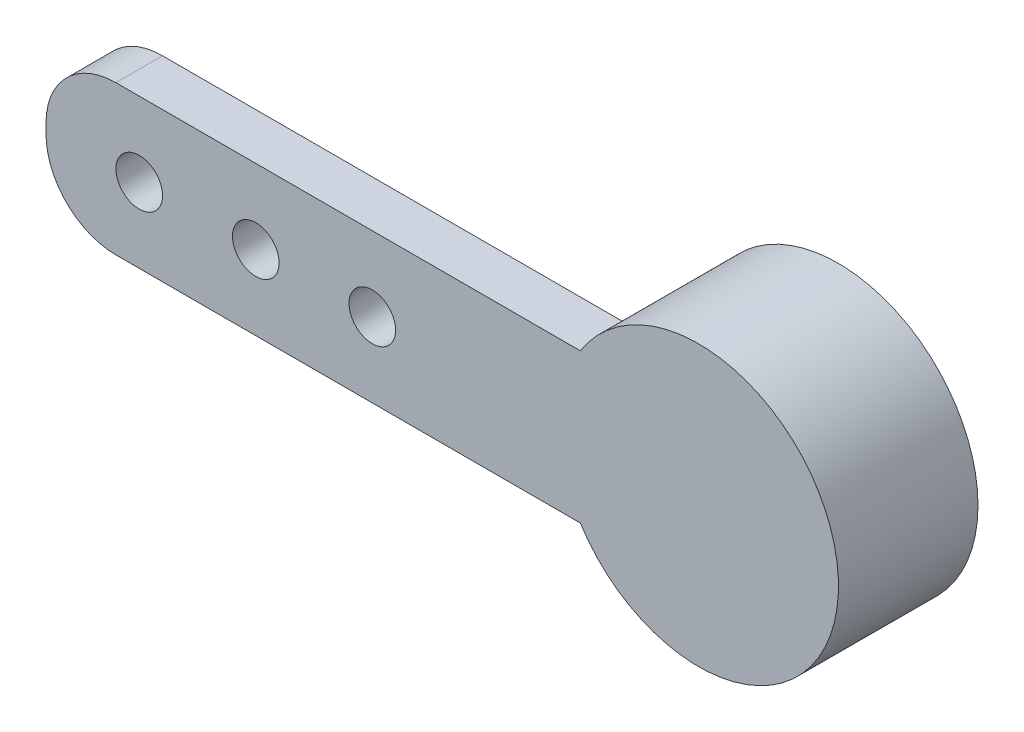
ISO-10303-21;
HEADER;
FILE_DESCRIPTION(('STEP AP214'),'2;1');
FILE_NAME('part.step','',(''),(''),'','','');
FILE_SCHEMA(('AUTOMOTIVE_DESIGN { 1 0 10303 214 1 1 1 1 }'));
ENDSEC;
DATA;
#1=APPLICATION_CONTEXT('core data for automotive mechanical design processes');
#2=APPLICATION_PROTOCOL_DEFINITION('international standard','automotive_design',2000,#1);
#3=PRODUCT_CONTEXT('',#1,'mechanical');
#4=PRODUCT('Part','Part','',(#3));
#5=PRODUCT_RELATED_PRODUCT_CATEGORY('part','',(#4));
#6=PRODUCT_DEFINITION_FORMATION('','',#4);
#7=PRODUCT_DEFINITION_CONTEXT('part definition',#1,'design');
#8=PRODUCT_DEFINITION('design','',#6,#7);
#9=PRODUCT_DEFINITION_SHAPE('','',#8);
#10=(LENGTH_UNIT() NAMED_UNIT(*) SI_UNIT(.MILLI.,.METRE.));
#11=(NAMED_UNIT(*) PLANE_ANGLE_UNIT() SI_UNIT($,.RADIAN.));
#12=(NAMED_UNIT(*) SI_UNIT($,.STERADIAN.) SOLID_ANGLE_UNIT());
#13=UNCERTAINTY_MEASURE_WITH_UNIT(LENGTH_MEASURE(1.E-05),#10,'distance_accuracy_value','');
#14=(GEOMETRIC_REPRESENTATION_CONTEXT(3) GLOBAL_UNCERTAINTY_ASSIGNED_CONTEXT((#13)) GLOBAL_UNIT_ASSIGNED_CONTEXT((#10,
#11,#12)) REPRESENTATION_CONTEXT('',''));
#15=CARTESIAN_POINT('',(0.,0.,0.));
#16=DIRECTION('',(0.,0.,1.));
#17=DIRECTION('',(1.,0.,0.));
#18=AXIS2_PLACEMENT_3D('',#15,#16,#17);
#19=CARTESIAN_POINT('',(-2.61728395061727,1.32778863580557,21.));
#20=DIRECTION('',(0.,0.,1.));
#21=DIRECTION('',(1.,0.,0.));
#22=AXIS2_PLACEMENT_3D('',#19,#20,#21);
#23=PLANE('',#22);
#24=DIRECTION('',(0.,-1.,0.));
#25=VECTOR('',#24,1.);
#26=CARTESIAN_POINT('',(-16.6172839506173,2.92778863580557,21.));
#27=LINE('',#26,#25);
#28=CARTESIAN_POINT('',(-16.6172839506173,1.42778863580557,21.));
#29=VERTEX_POINT('',#28);
#30=CARTESIAN_POINT('',(-16.6172839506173,1.22778863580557,21.));
#31=VERTEX_POINT('',#30);
#32=EDGE_CURVE('E136',#29,#31,#27,.T.);
#33=ORIENTED_EDGE('',*,*,#32,.T.);
#34=CARTESIAN_POINT('',(-15.1172839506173,1.22778863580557,21.));
#35=DIRECTION('',(0.,0.,1.));
#36=DIRECTION('',(1.,0.,0.));
#37=AXIS2_PLACEMENT_3D('',#34,#35,#36);
#38=CIRCLE('',#37,1.5);
#39=CARTESIAN_POINT('',(-15.1172839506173,-0.272211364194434,21.));
#40=VERTEX_POINT('',#39);
#41=EDGE_CURVE('E43',#31,#40,#38,.T.);
#42=ORIENTED_EDGE('',*,*,#41,.T.);
#43=DIRECTION('',(1.,0.,0.));
#44=VECTOR('',#43,1.);
#45=CARTESIAN_POINT('',(-16.6172839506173,-0.272211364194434,21.));
#46=LINE('',#45,#44);
#47=CARTESIAN_POINT('',(-5.15499945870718,-0.272211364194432,21.));
#48=VERTEX_POINT('',#47);
#49=EDGE_CURVE('E135',#40,#48,#46,.T.);
#50=ORIENTED_EDGE('',*,*,#49,.T.);
#51=CARTESIAN_POINT('',(-2.61728395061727,1.32778863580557,21.));
#52=DIRECTION('',(0.,0.,1.));
#53=DIRECTION('',(1.,0.,0.));
#54=AXIS2_PLACEMENT_3D('',#51,#52,#53);
#55=CIRCLE('',#54,3.);
#56=CARTESIAN_POINT('',(-5.15499945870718,2.92778863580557,21.));
#57=VERTEX_POINT('',#56);
#58=EDGE_CURVE('E114',#48,#57,#55,.T.);
#59=ORIENTED_EDGE('',*,*,#58,.T.);
#60=DIRECTION('',(-1.,0.,0.));
#61=VECTOR('',#60,1.);
#62=CARTESIAN_POINT('',(-16.6172839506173,2.92778863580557,21.));
#63=LINE('',#62,#61);
#64=CARTESIAN_POINT('',(-15.1172839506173,2.92778863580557,21.));
#65=VERTEX_POINT('',#64);
#66=EDGE_CURVE('E119',#57,#65,#63,.T.);
#67=ORIENTED_EDGE('',*,*,#66,.T.);
#68=CARTESIAN_POINT('',(-15.1172839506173,1.42778863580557,21.));
#69=DIRECTION('',(0.,0.,1.));
#70=DIRECTION('',(1.,0.,0.));
#71=AXIS2_PLACEMENT_3D('',#68,#69,#70);
#72=CIRCLE('',#71,1.5);
#73=EDGE_CURVE('E130',#65,#29,#72,.T.);
#74=ORIENTED_EDGE('',*,*,#73,.T.);
#75=EDGE_LOOP('',(#33,#42,#50,#59,#67,#74));
#76=FACE_BOUND('',#75,.T.);
#77=CARTESIAN_POINT('',(-12.1172839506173,1.32778863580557,21.));
#78=DIRECTION('',(0.,0.,1.));
#79=DIRECTION('',(1.,0.,0.));
#80=AXIS2_PLACEMENT_3D('',#77,#78,#79);
#81=CIRCLE('',#80,0.500000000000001);
#82=CARTESIAN_POINT('',(-11.6172839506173,1.32778863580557,21.));
#83=VERTEX_POINT('',#82);
#84=EDGE_CURVE('E198',#83,#83,#81,.T.);
#85=ORIENTED_EDGE('',*,*,#84,.F.);
#86=EDGE_LOOP('',(#85));
#87=FACE_BOUND('',#86,.T.);
#88=CARTESIAN_POINT('',(-14.6172839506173,1.32778863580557,21.));
#89=DIRECTION('',(0.,0.,1.));
#90=DIRECTION('',(1.,0.,0.));
#91=AXIS2_PLACEMENT_3D('',#88,#89,#90);
#92=CIRCLE('',#91,0.500000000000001);
#93=CARTESIAN_POINT('',(-14.1172839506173,1.32778863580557,21.));
#94=VERTEX_POINT('',#93);
#95=EDGE_CURVE('E143',#94,#94,#92,.T.);
#96=ORIENTED_EDGE('',*,*,#95,.F.);
#97=EDGE_LOOP('',(#96));
#98=FACE_BOUND('',#97,.T.);
#99=CARTESIAN_POINT('',(-9.61728395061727,1.32778863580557,21.));
#100=DIRECTION('',(0.,0.,1.));
#101=DIRECTION('',(1.,0.,0.));
#102=AXIS2_PLACEMENT_3D('',#99,#100,#101);
#103=CIRCLE('',#102,0.500000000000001);
#104=CARTESIAN_POINT('',(-9.11728395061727,1.32778863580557,21.));
#105=VERTEX_POINT('',#104);
#106=EDGE_CURVE('E204',#105,#105,#103,.T.);
#107=ORIENTED_EDGE('',*,*,#106,.F.);
#108=EDGE_LOOP('',(#107));
#109=FACE_BOUND('',#108,.T.);
#110=ADVANCED_FACE('F34',(#76,#87,#98,#109),#23,.T.);
#111=CARTESIAN_POINT('',(-9.61728395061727,1.32778863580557,21.));
#112=DIRECTION('',(0.,0.,-1.));
#113=DIRECTION('',(-1.,0.,0.));
#114=AXIS2_PLACEMENT_3D('',#111,#112,#113);
#115=CYLINDRICAL_SURFACE('',#114,0.500000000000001);
#116=ORIENTED_EDGE('',*,*,#106,.T.);
#117=EDGE_LOOP('',(#116));
#118=FACE_BOUND('',#117,.T.);
#119=CARTESIAN_POINT('',(-9.61728395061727,1.32778863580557,20.));
#120=DIRECTION('',(0.,0.,1.));
#121=DIRECTION('',(1.,0.,0.));
#122=AXIS2_PLACEMENT_3D('',#119,#120,#121);
#123=CIRCLE('',#122,0.500000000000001);
#124=CARTESIAN_POINT('',(-9.11728395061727,1.32778863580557,20.));
#125=VERTEX_POINT('',#124);
#126=EDGE_CURVE('E111',#125,#125,#123,.T.);
#127=ORIENTED_EDGE('',*,*,#126,.F.);
#128=EDGE_LOOP('',(#127));
#129=FACE_BOUND('',#128,.T.);
#130=ADVANCED_FACE('F163',(#118,#129),#115,.F.);
#131=CARTESIAN_POINT('',(-12.1172839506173,1.32778863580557,21.));
#132=DIRECTION('',(0.,0.,-1.));
#133=DIRECTION('',(-1.,0.,0.));
#134=AXIS2_PLACEMENT_3D('',#131,#132,#133);
#135=CYLINDRICAL_SURFACE('',#134,0.500000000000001);
#136=ORIENTED_EDGE('',*,*,#84,.T.);
#137=EDGE_LOOP('',(#136));
#138=FACE_BOUND('',#137,.T.);
#139=CARTESIAN_POINT('',(-12.1172839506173,1.32778863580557,20.));
#140=DIRECTION('',(0.,0.,1.));
#141=DIRECTION('',(1.,0.,0.));
#142=AXIS2_PLACEMENT_3D('',#139,#140,#141);
#143=CIRCLE('',#142,0.500000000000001);
#144=CARTESIAN_POINT('',(-11.6172839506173,1.32778863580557,20.));
#145=VERTEX_POINT('',#144);
#146=EDGE_CURVE('E200',#145,#145,#143,.T.);
#147=ORIENTED_EDGE('',*,*,#146,.F.);
#148=EDGE_LOOP('',(#147));
#149=FACE_BOUND('',#148,.T.);
#150=ADVANCED_FACE('F168',(#138,#149),#135,.F.);
#151=CARTESIAN_POINT('',(-14.6172839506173,1.32778863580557,21.));
#152=DIRECTION('',(0.,0.,-1.));
#153=DIRECTION('',(-1.,0.,0.));
#154=AXIS2_PLACEMENT_3D('',#151,#152,#153);
#155=CYLINDRICAL_SURFACE('',#154,0.500000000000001);
#156=ORIENTED_EDGE('',*,*,#95,.T.);
#157=EDGE_LOOP('',(#156));
#158=FACE_BOUND('',#157,.T.);
#159=CARTESIAN_POINT('',(-14.6172839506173,1.32778863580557,20.));
#160=DIRECTION('',(0.,0.,1.));
#161=DIRECTION('',(1.,0.,0.));
#162=AXIS2_PLACEMENT_3D('',#159,#160,#161);
#163=CIRCLE('',#162,0.500000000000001);
#164=CARTESIAN_POINT('',(-14.1172839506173,1.32778863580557,20.));
#165=VERTEX_POINT('',#164);
#166=EDGE_CURVE('E146',#165,#165,#163,.T.);
#167=ORIENTED_EDGE('',*,*,#166,.F.);
#168=EDGE_LOOP('',(#167));
#169=FACE_BOUND('',#168,.T.);
#170=ADVANCED_FACE('F173',(#158,#169),#155,.F.);
#171=CARTESIAN_POINT('',(-16.6172839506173,2.92778863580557,21.));
#172=DIRECTION('',(1.,0.,0.));
#173=DIRECTION('',(0.,0.,-1.));
#174=AXIS2_PLACEMENT_3D('',#171,#172,#173);
#175=PLANE('',#174);
#176=DIRECTION('',(0.,-1.,0.));
#177=VECTOR('',#176,1.);
#178=CARTESIAN_POINT('',(-16.6172839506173,2.92778863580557,20.));
#179=LINE('',#178,#177);
#180=CARTESIAN_POINT('',(-16.6172839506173,1.42778863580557,20.));
#181=VERTEX_POINT('',#180);
#182=CARTESIAN_POINT('',(-16.6172839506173,1.22778863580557,20.));
#183=VERTEX_POINT('',#182);
#184=EDGE_CURVE('E102',#181,#183,#179,.T.);
#185=ORIENTED_EDGE('',*,*,#184,.T.);
#186=DIRECTION('',(0.,0.,-1.));
#187=VECTOR('',#186,1.);
#188=CARTESIAN_POINT('',(-16.6172839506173,1.22778863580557,21.));
#189=LINE('',#188,#187);
#190=EDGE_CURVE('E56',#183,#31,#189,.F.);
#191=ORIENTED_EDGE('',*,*,#190,.T.);
#192=ORIENTED_EDGE('',*,*,#32,.F.);
#193=DIRECTION('',(0.,0.,-1.));
#194=VECTOR('',#193,1.);
#195=CARTESIAN_POINT('',(-16.6172839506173,1.42778863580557,21.));
#196=LINE('',#195,#194);
#197=EDGE_CURVE('E126',#29,#181,#196,.T.);
#198=ORIENTED_EDGE('',*,*,#197,.T.);
#199=EDGE_LOOP('',(#185,#191,#192,#198));
#200=FACE_BOUND('',#199,.T.);
#201=ADVANCED_FACE('F141',(#200),#175,.F.);
#202=CARTESIAN_POINT('',(-16.6172839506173,-0.272211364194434,21.));
#203=DIRECTION('',(0.,1.,0.));
#204=DIRECTION('',(-1.,0.,0.));
#205=AXIS2_PLACEMENT_3D('',#202,#203,#204);
#206=PLANE('',#205);
#207=ORIENTED_EDGE('',*,*,#49,.F.);
#208=DIRECTION('',(0.,0.,-1.));
#209=VECTOR('',#208,1.);
#210=CARTESIAN_POINT('',(-15.1172839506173,-0.272211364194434,21.));
#211=LINE('',#210,#209);
#212=CARTESIAN_POINT('',(-15.1172839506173,-0.272211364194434,20.));
#213=VERTEX_POINT('',#212);
#214=EDGE_CURVE('E99',#40,#213,#211,.T.);
#215=ORIENTED_EDGE('',*,*,#214,.T.);
#216=DIRECTION('',(1.,0.,0.));
#217=VECTOR('',#216,1.);
#218=CARTESIAN_POINT('',(-16.6172839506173,-0.272211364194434,20.));
#219=LINE('',#218,#217);
#220=CARTESIAN_POINT('',(-5.15499945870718,-0.272211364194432,20.));
#221=VERTEX_POINT('',#220);
#222=EDGE_CURVE('E91',#213,#221,#219,.T.);
#223=ORIENTED_EDGE('',*,*,#222,.T.);
#224=DIRECTION('',(0.,0.,-1.));
#225=VECTOR('',#224,1.);
#226=CARTESIAN_POINT('',(-5.15499945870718,-0.272211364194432,21.));
#227=LINE('',#226,#225);
#228=EDGE_CURVE('E96',#48,#221,#227,.T.);
#229=ORIENTED_EDGE('',*,*,#228,.F.);
#230=EDGE_LOOP('',(#207,#215,#223,#229));
#231=FACE_BOUND('',#230,.T.);
#232=ADVANCED_FACE('F94',(#231),#206,.F.);
#233=CARTESIAN_POINT('',(-2.61728395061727,1.32778863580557,20.));
#234=DIRECTION('',(0.,0.,1.));
#235=DIRECTION('',(1.,0.,0.));
#236=AXIS2_PLACEMENT_3D('',#233,#234,#235);
#237=PLANE('',#236);
#238=ORIENTED_EDGE('',*,*,#222,.F.);
#239=CARTESIAN_POINT('',(-15.1172839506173,1.22778863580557,20.));
#240=DIRECTION('',(0.,0.,1.));
#241=DIRECTION('',(1.,0.,0.));
#242=AXIS2_PLACEMENT_3D('',#239,#240,#241);
#243=CIRCLE('',#242,1.5);
#244=EDGE_CURVE('E124',#213,#183,#243,.F.);
#245=ORIENTED_EDGE('',*,*,#244,.T.);
#246=ORIENTED_EDGE('',*,*,#184,.F.);
#247=CARTESIAN_POINT('',(-15.1172839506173,1.42778863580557,20.));
#248=DIRECTION('',(0.,0.,1.));
#249=DIRECTION('',(1.,0.,0.));
#250=AXIS2_PLACEMENT_3D('',#247,#248,#249);
#251=CIRCLE('',#250,1.5);
#252=CARTESIAN_POINT('',(-15.1172839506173,2.92778863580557,20.));
#253=VERTEX_POINT('',#252);
#254=EDGE_CURVE('E117',#181,#253,#251,.F.);
#255=ORIENTED_EDGE('',*,*,#254,.T.);
#256=DIRECTION('',(-1.,0.,0.));
#257=VECTOR('',#256,1.);
#258=CARTESIAN_POINT('',(-16.6172839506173,2.92778863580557,20.));
#259=LINE('',#258,#257);
#260=CARTESIAN_POINT('',(-5.15499945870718,2.92778863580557,20.));
#261=VERTEX_POINT('',#260);
#262=EDGE_CURVE('E101',#261,#253,#259,.T.);
#263=ORIENTED_EDGE('',*,*,#262,.F.);
#264=CARTESIAN_POINT('',(-2.61728395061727,1.32778863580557,20.));
#265=DIRECTION('',(0.,0.,1.));
#266=DIRECTION('',(1.,0.,0.));
#267=AXIS2_PLACEMENT_3D('',#264,#265,#266);
#268=CIRCLE('',#267,3.);
#269=EDGE_CURVE('E105',#261,#221,#268,.T.);
#270=ORIENTED_EDGE('',*,*,#269,.T.);
#271=EDGE_LOOP('',(#238,#245,#246,#255,#263,#270));
#272=FACE_BOUND('',#271,.T.);
#273=ORIENTED_EDGE('',*,*,#166,.T.);
#274=EDGE_LOOP('',(#273));
#275=FACE_BOUND('',#274,.T.);
#276=ORIENTED_EDGE('',*,*,#146,.T.);
#277=EDGE_LOOP('',(#276));
#278=FACE_BOUND('',#277,.T.);
#279=ORIENTED_EDGE('',*,*,#126,.T.);
#280=EDGE_LOOP('',(#279));
#281=FACE_BOUND('',#280,.T.);
#282=ADVANCED_FACE('F106',(#272,#275,#278,#281),#237,.F.);
#283=CARTESIAN_POINT('',(-16.6172839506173,2.92778863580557,21.));
#284=DIRECTION('',(0.,-1.,0.));
#285=DIRECTION('',(1.,0.,0.));
#286=AXIS2_PLACEMENT_3D('',#283,#284,#285);
#287=PLANE('',#286);
#288=ORIENTED_EDGE('',*,*,#262,.T.);
#289=DIRECTION('',(0.,0.,-1.));
#290=VECTOR('',#289,1.);
#291=CARTESIAN_POINT('',(-15.1172839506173,2.92778863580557,21.));
#292=LINE('',#291,#290);
#293=EDGE_CURVE('E11',#253,#65,#292,.F.);
#294=ORIENTED_EDGE('',*,*,#293,.T.);
#295=ORIENTED_EDGE('',*,*,#66,.F.);
#296=DIRECTION('',(0.,0.,-1.));
#297=VECTOR('',#296,1.);
#298=CARTESIAN_POINT('',(-5.15499945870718,2.92778863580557,21.));
#299=LINE('',#298,#297);
#300=EDGE_CURVE('E115',#57,#261,#299,.T.);
#301=ORIENTED_EDGE('',*,*,#300,.T.);
#302=EDGE_LOOP('',(#288,#294,#295,#301));
#303=FACE_BOUND('',#302,.T.);
#304=ADVANCED_FACE('F177',(#303),#287,.F.);
#305=CARTESIAN_POINT('',(-2.61728395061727,1.32778863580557,21.));
#306=DIRECTION('',(0.,0.,-1.));
#307=DIRECTION('',(-1.,0.,0.));
#308=AXIS2_PLACEMENT_3D('',#305,#306,#307);
#309=CYLINDRICAL_SURFACE('',#308,3.);
#310=CARTESIAN_POINT('',(-2.61728395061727,1.32778863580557,18.0064691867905));
#311=DIRECTION('',(0.,0.,1.));
#312=DIRECTION('',(1.,0.,0.));
#313=AXIS2_PLACEMENT_3D('',#310,#311,#312);
#314=CIRCLE('',#313,3.);
#315=CARTESIAN_POINT('',(0.38271604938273,1.32778863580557,18.0064691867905));
#316=VERTEX_POINT('',#315);
#317=EDGE_CURVE('E38',#316,#316,#314,.T.);
#318=ORIENTED_EDGE('',*,*,#317,.T.);
#319=EDGE_LOOP('',(#318));
#320=FACE_BOUND('',#319,.T.);
#321=ORIENTED_EDGE('',*,*,#228,.T.);
#322=ORIENTED_EDGE('',*,*,#269,.F.);
#323=ORIENTED_EDGE('',*,*,#300,.F.);
#324=ORIENTED_EDGE('',*,*,#58,.F.);
#325=EDGE_LOOP('',(#321,#322,#323,#324));
#326=FACE_BOUND('',#325,.T.);
#327=ADVANCED_FACE('F113',(#320,#326),#309,.T.);
#328=CARTESIAN_POINT('',(-15.1172839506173,1.22778863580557,21.));
#329=DIRECTION('',(0.,0.,-1.));
#330=DIRECTION('',(-1.,0.,0.));
#331=AXIS2_PLACEMENT_3D('',#328,#329,#330);
#332=CYLINDRICAL_SURFACE('',#331,1.5);
#333=ORIENTED_EDGE('',*,*,#41,.F.);
#334=ORIENTED_EDGE('',*,*,#190,.F.);
#335=ORIENTED_EDGE('',*,*,#244,.F.);
#336=ORIENTED_EDGE('',*,*,#214,.F.);
#337=EDGE_LOOP('',(#333,#334,#335,#336));
#338=FACE_BOUND('',#337,.T.);
#339=ADVANCED_FACE('F139',(#338),#332,.T.);
#340=CARTESIAN_POINT('',(-15.1172839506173,1.42778863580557,21.));
#341=DIRECTION('',(0.,0.,-1.));
#342=DIRECTION('',(-1.,0.,0.));
#343=AXIS2_PLACEMENT_3D('',#340,#341,#342);
#344=CYLINDRICAL_SURFACE('',#343,1.5);
#345=ORIENTED_EDGE('',*,*,#73,.F.);
#346=ORIENTED_EDGE('',*,*,#293,.F.);
#347=ORIENTED_EDGE('',*,*,#254,.F.);
#348=ORIENTED_EDGE('',*,*,#197,.F.);
#349=EDGE_LOOP('',(#345,#346,#347,#348));
#350=FACE_BOUND('',#349,.T.);
#351=ADVANCED_FACE('F36',(#350),#344,.T.);
#352=CARTESIAN_POINT('',(27.2836262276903,-4.71604938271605,18.0064691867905));
#353=DIRECTION('',(0.,0.,1.));
#354=DIRECTION('',(1.,0.,0.));
#355=AXIS2_PLACEMENT_3D('',#352,#353,#354);
#356=PLANE('',#355);
#357=ORIENTED_EDGE('',*,*,#317,.F.);
#358=EDGE_LOOP('',(#357));
#359=FACE_BOUND('',#358,.T.);
#360=ADVANCED_FACE('F155',(#359),#356,.F.);
#361=CLOSED_SHELL('',(#110,#130,#150,#170,#201,#232,#282,#304,#327,#339,#351,#360));
#362=MANIFOLD_SOLID_BREP('B2',#361);
#363=ADVANCED_BREP_SHAPE_REPRESENTATION('',(#18,#362),#14);
#364=SHAPE_DEFINITION_REPRESENTATION(#9,#363);
ENDSEC;
END-ISO-10303-21;
